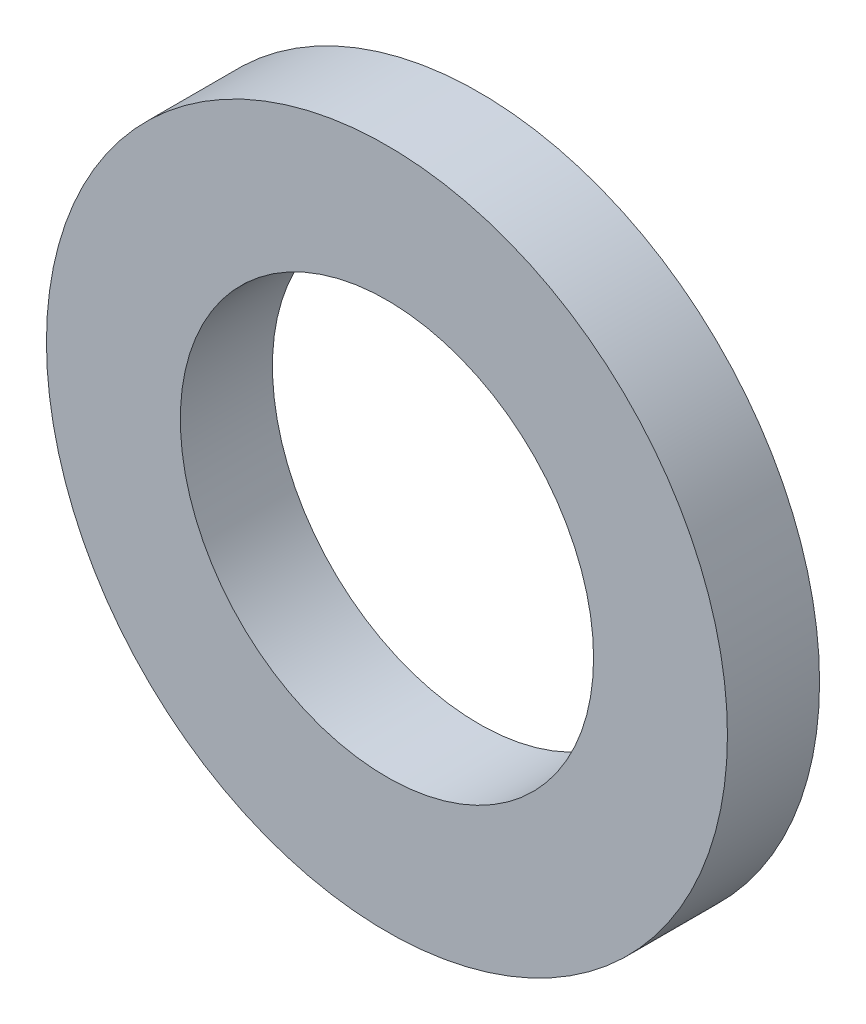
ISO-10303-21;
HEADER;
FILE_DESCRIPTION(('STEP AP214'),'2;1');
FILE_NAME('part.step','',(''),(''),'','','');
FILE_SCHEMA(('AUTOMOTIVE_DESIGN { 1 0 10303 214 1 1 1 1 }'));
ENDSEC;
DATA;
#1=APPLICATION_CONTEXT('core data for automotive mechanical design processes');
#2=APPLICATION_PROTOCOL_DEFINITION('international standard','automotive_design',2000,#1);
#3=PRODUCT_CONTEXT('',#1,'mechanical');
#4=PRODUCT('Part','Part','',(#3));
#5=PRODUCT_RELATED_PRODUCT_CATEGORY('part','',(#4));
#6=PRODUCT_DEFINITION_FORMATION('','',#4);
#7=PRODUCT_DEFINITION_CONTEXT('part definition',#1,'design');
#8=PRODUCT_DEFINITION('design','',#6,#7);
#9=PRODUCT_DEFINITION_SHAPE('','',#8);
#10=(LENGTH_UNIT() NAMED_UNIT(*) SI_UNIT(.MILLI.,.METRE.));
#11=(NAMED_UNIT(*) PLANE_ANGLE_UNIT() SI_UNIT($,.RADIAN.));
#12=(NAMED_UNIT(*) SI_UNIT($,.STERADIAN.) SOLID_ANGLE_UNIT());
#13=UNCERTAINTY_MEASURE_WITH_UNIT(LENGTH_MEASURE(1.E-05),#10,'distance_accuracy_value','');
#14=(GEOMETRIC_REPRESENTATION_CONTEXT(3) GLOBAL_UNCERTAINTY_ASSIGNED_CONTEXT((#13)) GLOBAL_UNIT_ASSIGNED_CONTEXT((#10,
#11,#12)) REPRESENTATION_CONTEXT('',''));
#15=CARTESIAN_POINT('',(0.,0.,0.));
#16=DIRECTION('',(0.,0.,1.));
#17=DIRECTION('',(1.,0.,0.));
#18=AXIS2_PLACEMENT_3D('',#15,#16,#17);
#19=CARTESIAN_POINT('',(0.,0.,1.49999999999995));
#20=DIRECTION('',(0.,0.,1.));
#21=DIRECTION('',(1.,0.,0.));
#22=AXIS2_PLACEMENT_3D('',#19,#20,#21);
#23=PLANE('',#22);
#24=CARTESIAN_POINT('',(0.,0.,1.49999999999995));
#25=DIRECTION('',(0.,0.,1.));
#26=DIRECTION('',(1.,0.,0.));
#27=AXIS2_PLACEMENT_3D('',#24,#25,#26);
#28=CIRCLE('',#27,5.545);
#29=CARTESIAN_POINT('',(5.545,0.,1.49999999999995));
#30=VERTEX_POINT('',#29);
#31=EDGE_CURVE('E10',#30,#30,#28,.T.);
#32=ORIENTED_EDGE('',*,*,#31,.T.);
#33=EDGE_LOOP('',(#32));
#34=FACE_BOUND('',#33,.T.);
#35=CARTESIAN_POINT('',(0.,0.,1.49999999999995));
#36=DIRECTION('',(0.,0.,1.));
#37=DIRECTION('',(1.,0.,0.));
#38=AXIS2_PLACEMENT_3D('',#35,#36,#37);
#39=CIRCLE('',#38,3.365);
#40=CARTESIAN_POINT('',(3.365,0.,1.49999999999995));
#41=VERTEX_POINT('',#40);
#42=EDGE_CURVE('E51',#41,#41,#39,.T.);
#43=ORIENTED_EDGE('',*,*,#42,.F.);
#44=EDGE_LOOP('',(#43));
#45=FACE_BOUND('',#44,.T.);
#46=ADVANCED_FACE('F40',(#34,#45),#23,.T.);
#47=CARTESIAN_POINT('',(0.,0.,0.));
#48=DIRECTION('',(0.,0.,1.));
#49=DIRECTION('',(1.,0.,0.));
#50=AXIS2_PLACEMENT_3D('',#47,#48,#49);
#51=PLANE('',#50);
#52=CARTESIAN_POINT('',(0.,0.,0.));
#53=DIRECTION('',(0.,0.,1.));
#54=DIRECTION('',(1.,0.,0.));
#55=AXIS2_PLACEMENT_3D('',#52,#53,#54);
#56=CIRCLE('',#55,5.545);
#57=CARTESIAN_POINT('',(5.545,0.,0.));
#58=VERTEX_POINT('',#57);
#59=EDGE_CURVE('E47',#58,#58,#56,.T.);
#60=ORIENTED_EDGE('',*,*,#59,.F.);
#61=EDGE_LOOP('',(#60));
#62=FACE_BOUND('',#61,.T.);
#63=CARTESIAN_POINT('',(0.,0.,0.));
#64=DIRECTION('',(0.,0.,1.));
#65=DIRECTION('',(1.,0.,0.));
#66=AXIS2_PLACEMENT_3D('',#63,#64,#65);
#67=CIRCLE('',#66,3.365);
#68=CARTESIAN_POINT('',(3.365,0.,0.));
#69=VERTEX_POINT('',#68);
#70=EDGE_CURVE('E55',#69,#69,#67,.T.);
#71=ORIENTED_EDGE('',*,*,#70,.T.);
#72=EDGE_LOOP('',(#71));
#73=FACE_BOUND('',#72,.T.);
#74=ADVANCED_FACE('F61',(#62,#73),#51,.F.);
#75=CARTESIAN_POINT('',(0.,0.,1.49999999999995));
#76=DIRECTION('',(0.,0.,-1.));
#77=DIRECTION('',(-1.,0.,0.));
#78=AXIS2_PLACEMENT_3D('',#75,#76,#77);
#79=CYLINDRICAL_SURFACE('',#78,5.545);
#80=ORIENTED_EDGE('',*,*,#31,.F.);
#81=EDGE_LOOP('',(#80));
#82=FACE_BOUND('',#81,.T.);
#83=ORIENTED_EDGE('',*,*,#59,.T.);
#84=EDGE_LOOP('',(#83));
#85=FACE_BOUND('',#84,.T.);
#86=ADVANCED_FACE('F42',(#82,#85),#79,.T.);
#87=CARTESIAN_POINT('',(0.,0.,1.49999999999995));
#88=DIRECTION('',(0.,0.,-1.));
#89=DIRECTION('',(-1.,0.,0.));
#90=AXIS2_PLACEMENT_3D('',#87,#88,#89);
#91=CYLINDRICAL_SURFACE('',#90,3.365);
#92=ORIENTED_EDGE('',*,*,#42,.T.);
#93=EDGE_LOOP('',(#92));
#94=FACE_BOUND('',#93,.T.);
#95=ORIENTED_EDGE('',*,*,#70,.F.);
#96=EDGE_LOOP('',(#95));
#97=FACE_BOUND('',#96,.T.);
#98=ADVANCED_FACE('F63',(#94,#97),#91,.F.);
#99=CLOSED_SHELL('',(#46,#74,#86,#98));
#100=MANIFOLD_SOLID_BREP('B2',#99);
#101=ADVANCED_BREP_SHAPE_REPRESENTATION('',(#18,#100),#14);
#102=SHAPE_DEFINITION_REPRESENTATION(#9,#101);
ENDSEC;
END-ISO-10303-21;
